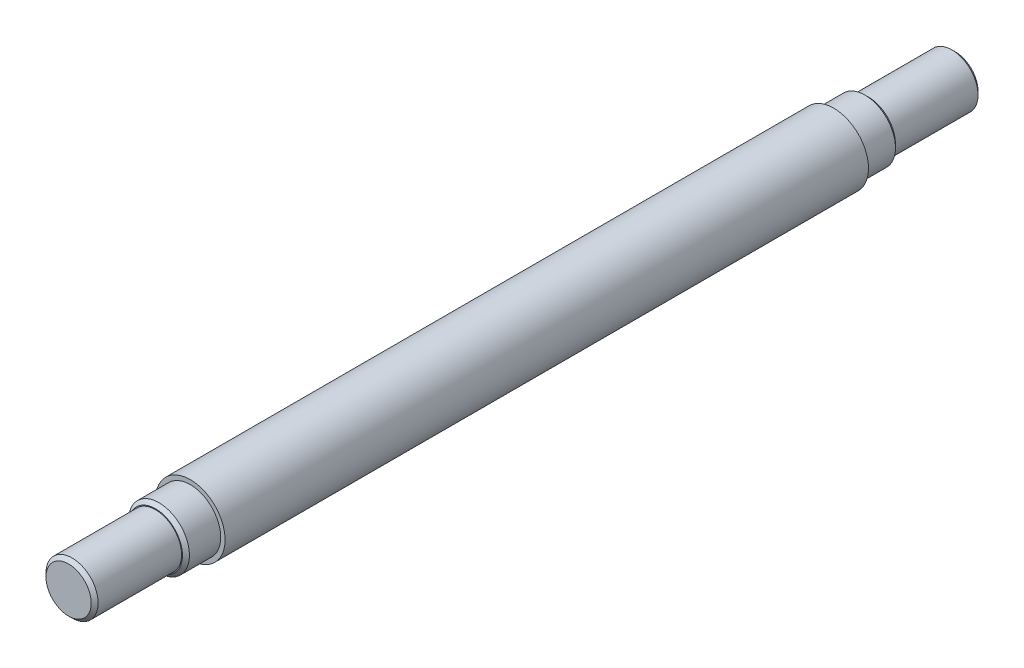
from build123d import *

# Parameters (mm, degrees)
SKETCH_1_R      = 20
EXTRUDE_1_DEPTH = 370
SKETCH_2_R      = 17.5
EXTRUDE_2_DEPTH = 20
EXTRUDE_START   = 20
SKETCH_3_R      = 17.5
EXTRUDE_3_DEPTH = 20
SKETCH_4_R      = 15
EXTRUDE_4_DEPTH = 50
EXTRUDE_START_2 = 50
SKETCH_5_R      = 15
EXTRUDE_5_DEPTH = 50
CHAMFER_1_SIZE  = 2
CHAMFER_2_SIZE  = 2


with BuildPart() as part:
    # Sketch 1 → Extrude 1 (new body)
    with BuildSketch(Plane.XY):
        Circle(SKETCH_1_R)
    extrude(amount=EXTRUDE_1_DEPTH)

    # Sketch 2 → Extrude 2 (add)
    with BuildSketch(Plane.XY.offset(370)):
        Circle(SKETCH_2_R)
    extrude(amount=EXTRUDE_2_DEPTH)

    # Sketch 3 → Extrude 3 (add)
    with BuildSketch(Plane(origin=(0, 0, 0), x_dir=(-1, 0, 0), z_dir=(0, 0, -1)).offset(EXTRUDE_START)):
        with Locations(Location((0, 0, 0), (0, 0, 180))):
            Circle(SKETCH_3_R)
    extrude(amount=-EXTRUDE_3_DEPTH)

    # Sketch 4 → Extrude 4 (add)
    with BuildSketch(Plane.XY.offset(390)):
        Circle(SKETCH_4_R)
    extrude(amount=EXTRUDE_4_DEPTH)

    # Sketch 5 → Extrude 5 (add)
    with BuildSketch(Plane(origin=(0, 0, -20), x_dir=(-1, 0, 0), z_dir=(0, 0, -1)).offset(EXTRUDE_START_2)):
        with Locations(Location((0, 0, 0), (0, 0, 180))):
            Circle(SKETCH_5_R)
    extrude(amount=-EXTRUDE_5_DEPTH)

    # Chamfer 1
    chamfer_1_edges = [part.edges().sort_by_distance(p)[0] for p in [
        (-17.5, 0, -20),
        (-17.5, 0, 390),
    ]]
    chamfer(chamfer_1_edges, length=CHAMFER_1_SIZE)

    # Chamfer 2
    chamfer_2_edges = [part.edges().sort_by_distance(p)[0] for p in [
        (-15, 0, 440),
        (-15, 0, -70),
    ]]
    chamfer(chamfer_2_edges, length=CHAMFER_2_SIZE)


solid = part.part
